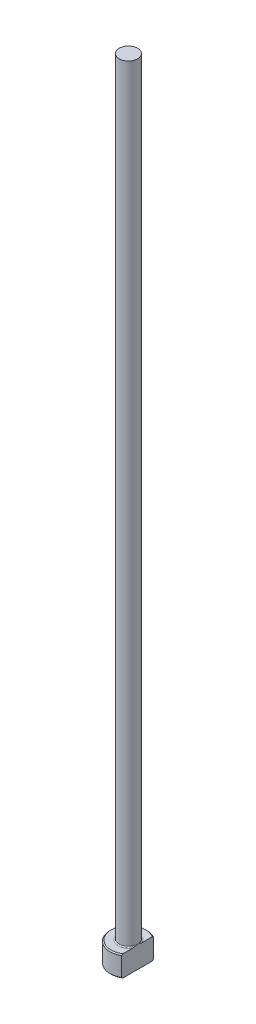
ISO-10303-21;
HEADER;
FILE_DESCRIPTION(('STEP AP214'),'2;1');
FILE_NAME('part.step','',(''),(''),'','','');
FILE_SCHEMA(('AUTOMOTIVE_DESIGN { 1 0 10303 214 1 1 1 1 }'));
ENDSEC;
DATA;
#1=APPLICATION_CONTEXT('core data for automotive mechanical design processes');
#2=APPLICATION_PROTOCOL_DEFINITION('international standard','automotive_design',2000,#1);
#3=PRODUCT_CONTEXT('',#1,'mechanical');
#4=PRODUCT('Part','Part','',(#3));
#5=PRODUCT_RELATED_PRODUCT_CATEGORY('part','',(#4));
#6=PRODUCT_DEFINITION_FORMATION('','',#4);
#7=PRODUCT_DEFINITION_CONTEXT('part definition',#1,'design');
#8=PRODUCT_DEFINITION('design','',#6,#7);
#9=PRODUCT_DEFINITION_SHAPE('','',#8);
#10=(LENGTH_UNIT() NAMED_UNIT(*) SI_UNIT(.MILLI.,.METRE.));
#11=(NAMED_UNIT(*) PLANE_ANGLE_UNIT() SI_UNIT($,.RADIAN.));
#12=(NAMED_UNIT(*) SI_UNIT($,.STERADIAN.) SOLID_ANGLE_UNIT());
#13=UNCERTAINTY_MEASURE_WITH_UNIT(LENGTH_MEASURE(1.E-05),#10,'distance_accuracy_value','');
#14=(GEOMETRIC_REPRESENTATION_CONTEXT(3) GLOBAL_UNCERTAINTY_ASSIGNED_CONTEXT((#13)) GLOBAL_UNIT_ASSIGNED_CONTEXT((#10,
#11,#12)) REPRESENTATION_CONTEXT('',''));
#15=CARTESIAN_POINT('',(0.,0.,0.));
#16=DIRECTION('',(0.,0.,1.));
#17=DIRECTION('',(1.,0.,0.));
#18=AXIS2_PLACEMENT_3D('',#15,#16,#17);
#19=CARTESIAN_POINT('',(0.,0.,0.));
#20=DIRECTION('',(0.,-1.,0.));
#21=DIRECTION('',(0.,0.,-1.));
#22=AXIS2_PLACEMENT_3D('',#19,#20,#21);
#23=PLANE('',#22);
#24=CARTESIAN_POINT('',(0.,0.,0.));
#25=DIRECTION('',(0.,-1.,0.));
#26=DIRECTION('',(0.,0.,-1.));
#27=AXIS2_PLACEMENT_3D('',#24,#25,#26);
#28=CIRCLE('',#27,3.29999999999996);
#29=CARTESIAN_POINT('',(1.74999999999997,0.,2.79776696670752));
#30=VERTEX_POINT('',#29);
#31=CARTESIAN_POINT('',(1.74999999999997,0.,-2.79776696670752));
#32=VERTEX_POINT('',#31);
#33=EDGE_CURVE('E98',#30,#32,#28,.T.);
#34=ORIENTED_EDGE('',*,*,#33,.T.);
#35=DIRECTION('',(0.,0.,1.));
#36=VECTOR('',#35,1.);
#37=CARTESIAN_POINT('',(1.74999999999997,0.,3.03108891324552));
#38=LINE('',#37,#36);
#39=EDGE_CURVE('E83',#32,#30,#38,.T.);
#40=ORIENTED_EDGE('',*,*,#39,.T.);
#41=EDGE_LOOP('',(#34,#40));
#42=FACE_BOUND('',#41,.T.);
#43=ADVANCED_FACE('F32',(#42),#23,.T.);
#44=CARTESIAN_POINT('',(0.,259.958771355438,0.));
#45=DIRECTION('',(0.,1.,0.));
#46=DIRECTION('',(0.,0.,1.));
#47=AXIS2_PLACEMENT_3D('',#44,#45,#46);
#48=CYLINDRICAL_SURFACE('',#47,3.49999999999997);
#49=CARTESIAN_POINT('',(0.,3.79999999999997,0.));
#50=DIRECTION('',(0.,1.,0.));
#51=DIRECTION('',(0.,0.,1.));
#52=AXIS2_PLACEMENT_3D('',#49,#50,#51);
#53=CIRCLE('',#52,3.49999999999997);
#54=CARTESIAN_POINT('',(1.74999999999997,3.79999999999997,3.03108891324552));
#55=VERTEX_POINT('',#54);
#56=CARTESIAN_POINT('',(1.74999999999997,3.79999999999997,-3.03108891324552));
#57=VERTEX_POINT('',#56);
#58=EDGE_CURVE('E104',#55,#57,#53,.F.);
#59=ORIENTED_EDGE('',*,*,#58,.T.);
#60=DIRECTION('',(0.,-1.,0.));
#61=VECTOR('',#60,1.);
#62=CARTESIAN_POINT('',(1.74999999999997,150.,-3.03108891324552));
#63=LINE('',#62,#61);
#64=CARTESIAN_POINT('',(1.74999999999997,0.200000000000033,-3.03108891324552));
#65=VERTEX_POINT('',#64);
#66=EDGE_CURVE('E183',#57,#65,#63,.T.);
#67=ORIENTED_EDGE('',*,*,#66,.T.);
#68=CARTESIAN_POINT('',(0.,0.200000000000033,0.));
#69=DIRECTION('',(0.,-1.,0.));
#70=DIRECTION('',(0.,0.,-1.));
#71=AXIS2_PLACEMENT_3D('',#68,#69,#70);
#72=CIRCLE('',#71,3.49999999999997);
#73=CARTESIAN_POINT('',(1.74999999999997,0.200000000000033,3.03108891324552));
#74=VERTEX_POINT('',#73);
#75=EDGE_CURVE('E100',#65,#74,#72,.F.);
#76=ORIENTED_EDGE('',*,*,#75,.T.);
#77=DIRECTION('',(0.,-1.,0.));
#78=VECTOR('',#77,1.);
#79=CARTESIAN_POINT('',(1.74999999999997,150.,3.03108891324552));
#80=LINE('',#79,#78);
#81=EDGE_CURVE('E93',#55,#74,#80,.T.);
#82=ORIENTED_EDGE('',*,*,#81,.F.);
#83=EDGE_LOOP('',(#59,#67,#76,#82));
#84=FACE_BOUND('',#83,.T.);
#85=ADVANCED_FACE('F158',(#84),#48,.T.);
#86=CARTESIAN_POINT('',(-3.49999999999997,4.,0.));
#87=DIRECTION('',(0.,1.,0.));
#88=DIRECTION('',(0.,0.,1.));
#89=AXIS2_PLACEMENT_3D('',#86,#87,#88);
#90=PLANE('',#89);
#91=CARTESIAN_POINT('',(0.,4.,0.));
#92=DIRECTION('',(0.,1.,0.));
#93=DIRECTION('',(0.,0.,1.));
#94=AXIS2_PLACEMENT_3D('',#91,#92,#93);
#95=CIRCLE('',#94,3.29999999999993);
#96=CARTESIAN_POINT('',(1.74999999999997,4.,-2.79776696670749));
#97=VERTEX_POINT('',#96);
#98=CARTESIAN_POINT('',(1.74999999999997,4.,2.79776696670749));
#99=VERTEX_POINT('',#98);
#100=EDGE_CURVE('E178',#97,#99,#95,.T.);
#101=ORIENTED_EDGE('',*,*,#100,.T.);
#102=DIRECTION('',(0.,0.,-1.));
#103=VECTOR('',#102,1.);
#104=CARTESIAN_POINT('',(1.74999999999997,4.,0.));
#105=LINE('',#104,#103);
#106=CARTESIAN_POINT('',(1.74999999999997,3.99999999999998,0.860232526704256));
#107=VERTEX_POINT('',#106);
#108=EDGE_CURVE('E57',#99,#107,#105,.T.);
#109=ORIENTED_EDGE('',*,*,#108,.T.);
#110=CARTESIAN_POINT('',(0.,4.,0.));
#111=DIRECTION('',(0.,1.,0.));
#112=DIRECTION('',(0.,0.,1.));
#113=AXIS2_PLACEMENT_3D('',#110,#111,#112);
#114=CIRCLE('',#113,1.94999999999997);
#115=CARTESIAN_POINT('',(1.74999999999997,3.99999999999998,-0.860232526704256));
#116=VERTEX_POINT('',#115);
#117=EDGE_CURVE('E107',#107,#116,#114,.F.);
#118=ORIENTED_EDGE('',*,*,#117,.T.);
#119=EDGE_CURVE('E136',#116,#97,#105,.T.);
#120=ORIENTED_EDGE('',*,*,#119,.T.);
#121=EDGE_LOOP('',(#101,#109,#118,#120));
#122=FACE_BOUND('',#121,.T.);
#123=ADVANCED_FACE('F147',(#122),#90,.T.);
#124=CARTESIAN_POINT('',(0.,4.,0.));
#125=DIRECTION('',(0.,-1.,0.));
#126=DIRECTION('',(0.,0.,-1.));
#127=AXIS2_PLACEMENT_3D('',#124,#125,#126);
#128=CONICAL_SURFACE('',#127,3.29999999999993,0.785398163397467);
#129=ORIENTED_EDGE('',*,*,#58,.F.);
#130=CARTESIAN_POINT('',(1.74999999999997,0.403691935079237,6.67057455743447));
#131=CARTESIAN_POINT('',(1.74999999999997,0.549902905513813,6.5194071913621));
#132=CARTESIAN_POINT('',(1.74999999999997,0.695956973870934,6.36808756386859));
#133=CARTESIAN_POINT('',(1.74999999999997,0.987658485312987,6.06505321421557));
#134=CARTESIAN_POINT('',(1.74999999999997,1.13330592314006,5.91333848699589));
#135=CARTESIAN_POINT('',(1.74999999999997,1.42417201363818,5.60934946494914));
#136=CARTESIAN_POINT('',(1.74999999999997,1.5693904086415,5.45707492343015));
#137=CARTESIAN_POINT('',(1.74999999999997,1.85918520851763,5.15191761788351));
#138=CARTESIAN_POINT('',(1.74999999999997,2.0037616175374,4.99903485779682));
#139=CARTESIAN_POINT('',(1.74999999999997,2.28922437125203,4.69552747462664));
#140=CARTESIAN_POINT('',(1.74999999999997,2.43012702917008,4.54491820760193));
#141=CARTESIAN_POINT('',(1.74999999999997,2.71087777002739,4.24272028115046));
#142=CARTESIAN_POINT('',(1.74999999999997,2.8507258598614,4.09113162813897));
#143=CARTESIAN_POINT('',(1.74999999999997,3.12895853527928,3.78667524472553));
#144=CARTESIAN_POINT('',(1.74999999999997,3.26734342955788,3.63380779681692));
#145=CARTESIAN_POINT('',(1.74999999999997,3.54209958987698,3.32627683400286));
#146=CARTESIAN_POINT('',(1.74999999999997,3.67847093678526,3.17161339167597));
#147=CARTESIAN_POINT('',(1.74999999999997,3.8961728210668,2.91990258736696));
#148=CARTESIAN_POINT('',(1.74999999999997,3.97843114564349,2.82365864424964));
#149=CARTESIAN_POINT('',(1.74999999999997,4.14148360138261,2.62991861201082));
#150=CARTESIAN_POINT('',(1.74999999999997,4.2222775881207,2.53242240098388));
#151=CARTESIAN_POINT('',(1.74999999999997,4.38274452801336,2.3347903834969));
#152=CARTESIAN_POINT('',(1.74999999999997,4.46239661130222,2.23463757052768));
#153=CARTESIAN_POINT('',(1.74999999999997,4.61891495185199,2.03220225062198));
#154=CARTESIAN_POINT('',(1.74999999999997,4.6957818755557,1.92992026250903));
#155=CARTESIAN_POINT('',(1.74999999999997,4.84669654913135,1.72090511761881));
#156=CARTESIAN_POINT('',(1.74999999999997,4.92068375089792,1.61412795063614));
#157=CARTESIAN_POINT('',(1.74999999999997,5.06269616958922,1.39638381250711));
#158=CARTESIAN_POINT('',(1.74999999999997,5.13071318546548,1.28541136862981));
#159=CARTESIAN_POINT('',(1.74999999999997,5.22516490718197,1.11561175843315));
#160=CARTESIAN_POINT('',(1.74999999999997,5.25522351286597,1.05881631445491));
#161=CARTESIAN_POINT('',(1.74999999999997,5.31237042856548,0.943756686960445));
#162=CARTESIAN_POINT('',(1.74999999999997,5.33945819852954,0.885492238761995));
#163=CARTESIAN_POINT('',(1.74999999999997,5.41499290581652,0.708569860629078));
#164=CARTESIAN_POINT('',(1.74999999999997,5.45796078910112,0.587356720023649));
#165=CARTESIAN_POINT('',(1.74999999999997,5.50447230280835,0.405622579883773));
#166=CARTESIAN_POINT('',(1.74999999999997,5.51680920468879,0.347327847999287));
#167=CARTESIAN_POINT('',(1.74999999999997,5.53592536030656,0.229813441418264));
#168=CARTESIAN_POINT('',(1.74999999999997,5.54270510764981,0.170593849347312));
#169=CARTESIAN_POINT('',(1.74999999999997,5.55022681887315,0.0519516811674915));
#170=CARTESIAN_POINT('',(1.74999999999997,5.5509874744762,-0.0074696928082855));
#171=CARTESIAN_POINT('',(1.74999999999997,5.54646541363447,-0.126082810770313));
#172=CARTESIAN_POINT('',(1.74999999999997,5.54118219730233,-0.185274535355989));
#173=CARTESIAN_POINT('',(1.74999999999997,5.525011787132,-0.302357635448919));
#174=CARTESIAN_POINT('',(1.74999999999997,5.51417270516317,-0.360255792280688));
#175=CARTESIAN_POINT('',(1.74999999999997,5.48756668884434,-0.474896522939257));
#176=CARTESIAN_POINT('',(1.74999999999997,5.47179916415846,-0.531638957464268));
#177=CARTESIAN_POINT('',(1.74999999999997,5.43599695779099,-0.644103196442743));
#178=CARTESIAN_POINT('',(1.74999999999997,5.41593824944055,-0.699817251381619));
#179=CARTESIAN_POINT('',(1.74999999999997,5.37235913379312,-0.809843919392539));
#180=CARTESIAN_POINT('',(1.74999999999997,5.34883943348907,-0.864156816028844));
#181=CARTESIAN_POINT('',(1.74999999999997,5.27385837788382,-1.02562379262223));
#182=CARTESIAN_POINT('',(1.74999999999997,5.21814894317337,-1.13079943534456));
#183=CARTESIAN_POINT('',(1.74999999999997,5.09935726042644,-1.33694307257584));
#184=CARTESIAN_POINT('',(1.74999999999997,5.03626572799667,-1.43790554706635));
#185=CARTESIAN_POINT('',(1.74999999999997,4.90490246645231,-1.63694628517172));
#186=CARTESIAN_POINT('',(1.74999999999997,4.83661129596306,-1.73501160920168));
#187=CARTESIAN_POINT('',(1.74999999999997,4.69663576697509,-1.92859117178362));
#188=CARTESIAN_POINT('',(1.74999999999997,4.62495312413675,-2.02410666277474));
#189=CARTESIAN_POINT('',(1.74999999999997,4.47817312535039,-2.21448054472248));
#190=CARTESIAN_POINT('',(1.74999999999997,4.40304324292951,-2.30931373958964));
#191=CARTESIAN_POINT('',(1.74999999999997,4.25092223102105,-2.49748629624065));
#192=CARTESIAN_POINT('',(1.74999999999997,4.17393090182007,-2.59082549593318));
#193=CARTESIAN_POINT('',(1.74999999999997,4.01873588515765,-2.77610276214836));
#194=CARTESIAN_POINT('',(1.74999999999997,3.94053559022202,-2.86804367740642));
#195=CARTESIAN_POINT('',(1.74999999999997,3.78305359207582,-3.0509955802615));
#196=CARTESIAN_POINT('',(1.74999999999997,3.70377186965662,-3.14200655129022));
#197=CARTESIAN_POINT('',(1.74999999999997,3.4917775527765,-3.38307713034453));
#198=CARTESIAN_POINT('',(1.74999999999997,3.35832098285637,-3.53248201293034));
#199=CARTESIAN_POINT('',(1.74999999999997,3.0897768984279,-3.82982116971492));
#200=CARTESIAN_POINT('',(1.74999999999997,2.95468933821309,-3.97775540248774));
#201=CARTESIAN_POINT('',(1.74999999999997,2.68319766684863,-4.27266697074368));
#202=CARTESIAN_POINT('',(1.74999999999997,2.54679243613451,-4.41964327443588));
#203=CARTESIAN_POINT('',(1.74999999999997,2.27308598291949,-4.71275937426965));
#204=CARTESIAN_POINT('',(1.74999999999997,2.13578475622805,-4.85889916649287));
#205=CARTESIAN_POINT('',(1.74999999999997,1.73418398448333,-5.28435414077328));
#206=CARTESIAN_POINT('',(1.74999999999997,1.46897142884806,-5.5628072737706));
#207=CARTESIAN_POINT('',(1.74999999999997,1.07010496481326,-5.97918348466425));
#208=CARTESIAN_POINT('',(1.74999999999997,0.937049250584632,-6.11768155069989));
#209=CARTESIAN_POINT('',(1.74999999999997,0.670604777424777,-6.39435480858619));
#210=CARTESIAN_POINT('',(1.74999999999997,0.53721602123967,-6.53253000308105));
#211=CARTESIAN_POINT('',(1.74999999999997,0.403691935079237,-6.67057455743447));
#212=B_SPLINE_CURVE_WITH_KNOTS('',3,(#130,#131,#132,#133,#134,#135,#136,#137,#138,#139,#140,
#141,#142,#143,#144,#145,#146,#147,#148,#149,#150,#151,#152,#153,#154,#155,#156,#157,#158,#159,
#160,#161,#162,#163,#164,#165,#166,#167,#168,#169,#170,#171,#172,#173,#174,#175,#176,#177,#178,
#179,#180,#181,#182,#183,#184,#185,#186,#187,#188,#189,#190,#191,#192,#193,#194,#195,#196,#197,
#198,#199,#200,#201,#202,#203,#204,#205,#206,#207,#208,#209,#210,#211),.UNSPECIFIED.,.F.,.F.,(4,
2,2,2,2,2,2,2,2,2,2,2,2,2,2,2,2,2,2,2,2,2,2,2,2,2,2,2,2,2,2,2,2,2,2,2,2,2,2,2,4),(0.,
0.63092275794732,1.26185363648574,1.89310749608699,2.5243572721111,3.14308654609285,
3.76181177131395,4.38040374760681,4.9989708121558,5.37878108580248,5.75862861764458,
6.14249031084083,6.52625953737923,6.91585739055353,7.30598230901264,7.4986761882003,
7.69140503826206,8.07538783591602,8.25392686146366,8.43245002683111,8.61041858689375,
8.78840186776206,8.96486927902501,9.1413578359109,9.3188617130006,9.49632938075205,
9.8528627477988,10.209849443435,10.5682434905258,10.9264581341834,11.2893876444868,
11.6523562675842,12.014444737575,12.3765396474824,12.977513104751,13.5785034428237,
14.1800594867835,14.7816183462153,15.9352370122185,16.5114050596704,17.0875683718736),.UNSPECIFIED.);
#213=EDGE_CURVE('E135',#55,#99,#212,.T.);
#214=ORIENTED_EDGE('',*,*,#213,.T.);
#215=ORIENTED_EDGE('',*,*,#100,.F.);
#216=EDGE_CURVE('E127',#97,#57,#212,.T.);
#217=ORIENTED_EDGE('',*,*,#216,.T.);
#218=EDGE_LOOP('',(#129,#214,#215,#217));
#219=FACE_BOUND('',#218,.T.);
#220=ADVANCED_FACE('F143',(#219),#128,.T.);
#221=CARTESIAN_POINT('',(0.,0.200000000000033,0.));
#222=DIRECTION('',(0.,1.,0.));
#223=DIRECTION('',(0.,0.,1.));
#224=AXIS2_PLACEMENT_3D('',#221,#222,#223);
#225=CONICAL_SURFACE('',#224,3.49999999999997,0.785398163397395);
#226=ORIENTED_EDGE('',*,*,#75,.F.);
#227=CARTESIAN_POINT('',(1.74999999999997,3.59630806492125,-6.67057455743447));
#228=CARTESIAN_POINT('',(1.74999999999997,3.45009709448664,-6.51940719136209));
#229=CARTESIAN_POINT('',(1.74999999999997,3.30404302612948,-6.36808756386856));
#230=CARTESIAN_POINT('',(1.74999999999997,3.01234151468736,-6.06505321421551));
#231=CARTESIAN_POINT('',(1.74999999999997,2.86669407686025,-5.91333848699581));
#232=CARTESIAN_POINT('',(1.74999999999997,2.57582798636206,-5.60934946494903));
#233=CARTESIAN_POINT('',(1.74999999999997,2.4306095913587,-5.45707492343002));
#234=CARTESIAN_POINT('',(1.74999999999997,2.1408147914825,-5.15191761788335));
#235=CARTESIAN_POINT('',(1.74999999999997,1.9962383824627,-4.99903485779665));
#236=CARTESIAN_POINT('',(1.74999999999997,1.710775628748,-4.69552747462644));
#237=CARTESIAN_POINT('',(1.74999999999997,1.56987297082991,-4.54491820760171));
#238=CARTESIAN_POINT('',(1.74999999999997,1.28912222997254,-4.24272028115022));
#239=CARTESIAN_POINT('',(1.74999999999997,1.1492741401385,-4.09113162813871));
#240=CARTESIAN_POINT('',(1.74999999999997,0.871041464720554,-3.78667524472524));
#241=CARTESIAN_POINT('',(1.74999999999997,0.732656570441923,-3.63380779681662));
#242=CARTESIAN_POINT('',(1.74999999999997,0.457900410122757,-3.32627683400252));
#243=CARTESIAN_POINT('',(1.74999999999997,0.321529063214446,-3.17161339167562));
#244=CARTESIAN_POINT('',(1.74999999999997,0.103827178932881,-2.9199025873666));
#245=CARTESIAN_POINT('',(1.74999999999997,0.021568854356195,-2.8236586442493));
#246=CARTESIAN_POINT('',(1.74999999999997,-0.141483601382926,-2.62991861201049));
#247=CARTESIAN_POINT('',(1.74999999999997,-0.222277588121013,-2.53242240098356));
#248=CARTESIAN_POINT('',(1.74999999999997,-0.382744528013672,-2.33479038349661));
#249=CARTESIAN_POINT('',(1.74999999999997,-0.462396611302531,-2.23463757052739));
#250=CARTESIAN_POINT('',(1.74999999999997,-0.618914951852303,-2.03220225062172));
#251=CARTESIAN_POINT('',(1.74999999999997,-0.695781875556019,-1.92992026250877));
#252=CARTESIAN_POINT('',(1.74999999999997,-0.846696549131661,-1.72090511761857));
#253=CARTESIAN_POINT('',(1.74999999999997,-0.920683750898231,-1.61412795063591));
#254=CARTESIAN_POINT('',(1.74999999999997,-1.06269616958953,-1.39638381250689));
#255=CARTESIAN_POINT('',(1.74999999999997,-1.13071318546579,-1.2854113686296));
#256=CARTESIAN_POINT('',(1.74999999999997,-1.22516490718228,-1.11561175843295));
#257=CARTESIAN_POINT('',(1.74999999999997,-1.25522351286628,-1.05881631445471));
#258=CARTESIAN_POINT('',(1.74999999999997,-1.31237042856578,-0.943756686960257));
#259=CARTESIAN_POINT('',(1.74999999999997,-1.33945819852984,-0.885492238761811));
#260=CARTESIAN_POINT('',(1.74999999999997,-1.41499290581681,-0.708569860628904));
#261=CARTESIAN_POINT('',(1.74999999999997,-1.45796078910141,-0.587356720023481));
#262=CARTESIAN_POINT('',(1.74999999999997,-1.50447230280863,-0.405622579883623));
#263=CARTESIAN_POINT('',(1.74999999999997,-1.51680920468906,-0.347327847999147));
#264=CARTESIAN_POINT('',(1.74999999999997,-1.53592536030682,-0.229813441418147));
#265=CARTESIAN_POINT('',(1.74999999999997,-1.54270510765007,-0.170593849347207));
#266=CARTESIAN_POINT('',(1.74999999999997,-1.5502268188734,-0.0519516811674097));
#267=CARTESIAN_POINT('',(1.74999999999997,-1.55098747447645,0.00746969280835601));
#268=CARTESIAN_POINT('',(1.74999999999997,-1.54646541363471,0.126082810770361));
#269=CARTESIAN_POINT('',(1.74999999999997,-1.54118219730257,0.185274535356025));
#270=CARTESIAN_POINT('',(1.74999999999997,-1.52501178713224,0.302357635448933));
#271=CARTESIAN_POINT('',(1.74999999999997,-1.51417270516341,0.360255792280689));
#272=CARTESIAN_POINT('',(1.74999999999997,-1.48756668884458,0.474896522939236));
#273=CARTESIAN_POINT('',(1.74999999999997,-1.4717991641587,0.531638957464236));
#274=CARTESIAN_POINT('',(1.74999999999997,-1.43599695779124,0.644103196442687));
#275=CARTESIAN_POINT('',(1.74999999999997,-1.4159382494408,0.699817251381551));
#276=CARTESIAN_POINT('',(1.74999999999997,-1.37235913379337,0.809843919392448));
#277=CARTESIAN_POINT('',(1.74999999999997,-1.34883943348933,0.864156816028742));
#278=CARTESIAN_POINT('',(1.74999999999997,-1.2738583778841,1.02562379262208));
#279=CARTESIAN_POINT('',(1.74999999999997,-1.21814894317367,1.13079943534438));
#280=CARTESIAN_POINT('',(1.74999999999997,-1.09935726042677,1.33694307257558));
#281=CARTESIAN_POINT('',(1.74999999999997,-1.03626572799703,1.43790554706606));
#282=CARTESIAN_POINT('',(1.74999999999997,-0.904902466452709,1.63694628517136));
#283=CARTESIAN_POINT('',(1.74999999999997,-0.83661129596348,1.73501160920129));
#284=CARTESIAN_POINT('',(1.74999999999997,-0.69663576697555,1.92859117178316));
#285=CARTESIAN_POINT('',(1.74999999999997,-0.624953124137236,2.02410666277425));
#286=CARTESIAN_POINT('',(1.74999999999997,-0.47817312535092,2.21448054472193));
#287=CARTESIAN_POINT('',(1.74999999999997,-0.403043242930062,2.30931373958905));
#288=CARTESIAN_POINT('',(1.74999999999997,-0.250922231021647,2.49748629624));
#289=CARTESIAN_POINT('',(1.74999999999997,-0.173930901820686,2.5908254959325));
#290=CARTESIAN_POINT('',(1.74999999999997,-0.0187358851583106,2.77610276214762));
#291=CARTESIAN_POINT('',(1.74999999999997,0.059464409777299,2.86804367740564));
#292=CARTESIAN_POINT('',(1.74999999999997,0.216946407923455,3.05099558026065));
#293=CARTESIAN_POINT('',(1.74999999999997,0.296228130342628,3.14200655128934));
#294=CARTESIAN_POINT('',(1.74999999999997,0.508222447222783,3.38307713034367));
#295=CARTESIAN_POINT('',(1.74999999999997,0.641679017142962,3.53248201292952));
#296=CARTESIAN_POINT('',(1.74999999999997,0.910223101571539,3.82982116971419));
#297=CARTESIAN_POINT('',(1.74999999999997,1.04531066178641,3.97775540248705));
#298=CARTESIAN_POINT('',(1.74999999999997,1.31680233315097,4.27266697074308));
#299=CARTESIAN_POINT('',(1.74999999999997,1.45320756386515,4.41964327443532));
#300=CARTESIAN_POINT('',(1.74999999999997,1.72691401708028,4.71275937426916));
#301=CARTESIAN_POINT('',(1.74999999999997,1.86421524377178,4.85889916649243));
#302=CARTESIAN_POINT('',(1.74999999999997,2.26581601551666,5.28435414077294));
#303=CARTESIAN_POINT('',(1.74999999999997,2.53102857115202,5.56280727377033));
#304=CARTESIAN_POINT('',(1.74999999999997,2.92989503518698,5.97918348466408));
#305=CARTESIAN_POINT('',(1.74999999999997,3.06295074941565,6.11768155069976));
#306=CARTESIAN_POINT('',(1.74999999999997,3.32939522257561,6.39435480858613));
#307=CARTESIAN_POINT('',(1.74999999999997,3.46278397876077,6.53253000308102));
#308=CARTESIAN_POINT('',(1.74999999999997,3.59630806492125,6.67057455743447));
#309=B_SPLINE_CURVE_WITH_KNOTS('',3,(#227,#228,#229,#230,#231,#232,#233,#234,#235,#236,#237,
#238,#239,#240,#241,#242,#243,#244,#245,#246,#247,#248,#249,#250,#251,#252,#253,#254,#255,#256,
#257,#258,#259,#260,#261,#262,#263,#264,#265,#266,#267,#268,#269,#270,#271,#272,#273,#274,#275,
#276,#277,#278,#279,#280,#281,#282,#283,#284,#285,#286,#287,#288,#289,#290,#291,#292,#293,#294,
#295,#296,#297,#298,#299,#300,#301,#302,#303,#304,#305,#306,#307,#308),.UNSPECIFIED.,.F.,.F.,(4,
2,2,2,2,2,2,2,2,2,2,2,2,2,2,2,2,2,2,2,2,2,2,2,2,2,2,2,2,2,2,2,2,2,2,2,2,2,2,2,4),(0.,
0.630922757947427,1.26185363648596,1.89310749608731,2.52435727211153,3.14308654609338,
3.76181177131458,4.38040374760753,4.99897081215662,5.37878108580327,5.75862861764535,
6.14249031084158,6.52625953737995,6.91585739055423,7.30598230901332,7.49867618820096,
7.69140503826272,8.07538783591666,8.25392686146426,8.43245002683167,8.61041858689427,
8.78840186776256,8.96486927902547,9.14135783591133,9.318861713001,9.49632938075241,
9.85286274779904,10.2098494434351,10.5682434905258,10.9264581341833,11.2893876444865,
11.6523562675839,12.0144447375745,12.3765396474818,12.9775131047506,13.5785034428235,
14.1800594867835,14.7816183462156,15.9352370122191,16.5114050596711,17.0875683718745),.UNSPECIFIED.);
#310=EDGE_CURVE('E86',#65,#32,#309,.T.);
#311=ORIENTED_EDGE('',*,*,#310,.T.);
#312=ORIENTED_EDGE('',*,*,#33,.F.);
#313=EDGE_CURVE('E89',#30,#74,#309,.T.);
#314=ORIENTED_EDGE('',*,*,#313,.T.);
#315=EDGE_LOOP('',(#226,#311,#312,#314));
#316=FACE_BOUND('',#315,.T.);
#317=ADVANCED_FACE('F97',(#316),#225,.T.);
#318=CARTESIAN_POINT('',(0.,4.19999999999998,0.));
#319=DIRECTION('',(0.,1.,0.));
#320=DIRECTION('',(0.,0.,1.));
#321=AXIS2_PLACEMENT_3D('',#318,#319,#320);
#322=TOROIDAL_SURFACE('',#321,1.94999999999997,0.2);
#323=CARTESIAN_POINT('',(1.74999999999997,4.19999999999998,0.));
#324=CARTESIAN_POINT('',(1.74999999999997,4.2000005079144,9.3867964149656E-11));
#325=CARTESIAN_POINT('',(1.74999999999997,4.20000101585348,-1.34501103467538E-07));
#326=CARTESIAN_POINT('',(1.74999999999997,4.20000198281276,-5.41283480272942E-07));
#327=CARTESIAN_POINT('',(1.74999999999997,4.20000243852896,-8.19487716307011E-07));
#328=CARTESIAN_POINT('',(1.74999999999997,4.2000033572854,-1.4843911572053E-06));
#329=CARTESIAN_POINT('',(1.74999999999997,4.20000381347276,-1.8805263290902E-06));
#330=CARTESIAN_POINT('',(1.74999999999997,4.2000046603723,-2.72280867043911E-06));
#331=CARTESIAN_POINT('',(1.74999999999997,4.20000505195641,-3.16812554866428E-06));
#332=CARTESIAN_POINT('',(1.74999999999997,4.20000641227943,-4.80772283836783E-06));
#333=CARTESIAN_POINT('',(1.74999999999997,4.20000730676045,-6.06508173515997E-06));
#334=CARTESIAN_POINT('',(1.74999999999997,4.20000885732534,-8.62364313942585E-06));
#335=CARTESIAN_POINT('',(1.74999999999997,4.2000095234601,-9.91907771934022E-06));
#336=CARTESIAN_POINT('',(1.74999999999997,4.20001212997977,-1.51310766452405E-05));
#337=CARTESIAN_POINT('',(1.74999999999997,4.20001395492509,-1.91092656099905E-05));
#338=CARTESIAN_POINT('',(1.74999999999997,4.200016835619,-2.68327807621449E-05));
#339=CARTESIAN_POINT('',(1.74999999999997,4.20001795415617,-3.05551301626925E-05));
#340=CARTESIAN_POINT('',(1.74999999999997,4.20002287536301,-4.68261375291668E-05));
#341=CARTESIAN_POINT('',(1.74999999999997,4.20002674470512,-5.93446279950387E-05));
#342=CARTESIAN_POINT('',(1.74999999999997,4.20003278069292,-8.25255943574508E-05));
#343=CARTESIAN_POINT('',(1.74999999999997,4.2000351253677,-9.31393224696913E-05));
#344=CARTESIAN_POINT('',(1.74999999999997,4.20005413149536,-0.000171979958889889));
#345=CARTESIAN_POINT('',(1.74999999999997,4.20007897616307,-0.000237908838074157));
#346=CARTESIAN_POINT('',(1.74999999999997,4.20017305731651,-0.000496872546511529));
#347=CARTESIAN_POINT('',(1.74999999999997,4.20023617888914,-0.000691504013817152));
#348=CARTESIAN_POINT('',(1.74999999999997,4.20048774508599,-0.00145613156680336));
#349=CARTESIAN_POINT('',(1.74999999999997,4.20068259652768,-0.00202450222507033));
#350=CARTESIAN_POINT('',(1.74999999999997,4.20148279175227,-0.00436941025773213));
#351=CARTESIAN_POINT('',(1.74999999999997,4.20208089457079,-0.00614773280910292));
#352=CARTESIAN_POINT('',(1.74999999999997,4.20853845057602,-0.0253339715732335));
#353=CARTESIAN_POINT('',(1.74999999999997,4.21443574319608,-0.0427328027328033));
#354=CARTESIAN_POINT('',(1.74999999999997,4.22594434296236,-0.076884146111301));
#355=CARTESIAN_POINT('',(1.74999999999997,4.23155796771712,-0.0936359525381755));
#356=CARTESIAN_POINT('',(1.74999999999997,4.24339960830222,-0.129193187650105));
#357=CARTESIAN_POINT('',(1.74999999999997,4.24961959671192,-0.148001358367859));
#358=CARTESIAN_POINT('',(1.74999999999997,4.26199268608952,-0.185858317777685));
#359=CARTESIAN_POINT('',(1.74999999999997,4.26814439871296,-0.204907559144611));
#360=CARTESIAN_POINT('',(1.74999999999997,4.28302129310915,-0.251728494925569));
#361=CARTESIAN_POINT('',(1.74999999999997,4.2916463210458,-0.279532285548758));
#362=CARTESIAN_POINT('',(1.74999999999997,4.30815507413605,-0.334622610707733));
#363=CARTESIAN_POINT('',(1.74999999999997,4.3160517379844,-0.36190524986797));
#364=CARTESIAN_POINT('',(1.74999999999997,4.33270110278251,-0.422187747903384));
#365=CARTESIAN_POINT('',(1.74999999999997,4.34130455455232,-0.455229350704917));
#366=CARTESIAN_POINT('',(1.74999999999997,4.35728256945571,-0.521873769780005));
#367=CARTESIAN_POINT('',(1.74999999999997,4.36464748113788,-0.555478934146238));
#368=CARTESIAN_POINT('',(1.74999999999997,4.37810121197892,-0.625225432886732));
#369=CARTESIAN_POINT('',(1.74999999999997,4.38407559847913,-0.661389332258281));
#370=CARTESIAN_POINT('',(1.74999999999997,4.39348021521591,-0.733973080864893));
#371=CARTESIAN_POINT('',(1.74999999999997,4.39691695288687,-0.77039203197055));
#372=CARTESIAN_POINT('',(1.74999999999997,4.39990626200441,-0.832262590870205));
#373=CARTESIAN_POINT('',(1.74999999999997,4.40032395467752,-0.857670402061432));
#374=CARTESIAN_POINT('',(1.74999999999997,4.39916217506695,-0.908260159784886));
#375=CARTESIAN_POINT('',(1.74999999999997,4.39759783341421,-0.933442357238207));
#376=CARTESIAN_POINT('',(1.74999999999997,4.39129859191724,-0.989903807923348));
#377=CARTESIAN_POINT('',(1.74999999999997,4.38586007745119,-1.02110925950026));
#378=CARTESIAN_POINT('',(1.74999999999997,4.36964168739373,-1.08216800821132));
#379=CARTESIAN_POINT('',(1.74999999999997,4.35888918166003,-1.11202738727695));
#380=CARTESIAN_POINT('',(1.74999999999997,4.33961802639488,-1.14878048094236));
#381=CARTESIAN_POINT('',(1.74999999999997,4.33455492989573,-1.15748014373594));
#382=CARTESIAN_POINT('',(1.74999999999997,4.32351587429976,-1.17429661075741));
#383=CARTESIAN_POINT('',(1.74999999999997,4.31753946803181,-1.18241312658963));
#384=CARTESIAN_POINT('',(1.74999999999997,4.30451428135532,-1.19787793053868));
#385=CARTESIAN_POINT('',(1.74999999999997,4.29745609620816,-1.20521842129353));
#386=CARTESIAN_POINT('',(1.74999999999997,4.28223524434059,-1.21865698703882));
#387=CARTESIAN_POINT('',(1.74999999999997,4.27407476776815,-1.22475746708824));
#388=CARTESIAN_POINT('',(1.74999999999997,4.25920166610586,-1.23370537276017));
#389=CARTESIAN_POINT('',(1.74999999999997,4.25274944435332,-1.23698363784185));
#390=CARTESIAN_POINT('',(1.74999999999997,4.23939659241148,-1.24245066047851));
#391=CARTESIAN_POINT('',(1.74999999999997,4.23249637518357,-1.2446404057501));
#392=CARTESIAN_POINT('',(1.74999999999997,4.21836445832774,-1.24776583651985));
#393=CARTESIAN_POINT('',(1.74999999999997,4.21113087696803,-1.24869317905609));
#394=CARTESIAN_POINT('',(1.74999999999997,4.19661788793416,-1.24917680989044));
#395=CARTESIAN_POINT('',(1.74999999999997,4.18933848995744,-1.2487333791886));
#396=CARTESIAN_POINT('',(1.74999999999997,4.17564813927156,-1.2466228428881));
#397=CARTESIAN_POINT('',(1.74999999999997,4.16921873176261,-1.24507159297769));
#398=CARTESIAN_POINT('',(1.74999999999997,4.1566813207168,-1.24099086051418));
#399=CARTESIAN_POINT('',(1.74999999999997,4.15057343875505,-1.23846101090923));
#400=CARTESIAN_POINT('',(1.74999999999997,4.13656990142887,-1.23147130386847));
#401=CARTESIAN_POINT('',(1.74999999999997,4.12885825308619,-1.22664351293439));
#402=CARTESIAN_POINT('',(1.74999999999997,4.11430996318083,-1.21581214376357));
#403=CARTESIAN_POINT('',(1.74999999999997,4.10747539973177,-1.20980585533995));
#404=CARTESIAN_POINT('',(1.74999999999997,4.09141283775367,-1.19367262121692));
#405=CARTESIAN_POINT('',(1.74999999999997,4.08273353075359,-1.18300273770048));
#406=CARTESIAN_POINT('',(1.74999999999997,4.06710756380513,-1.16049397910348));
#407=CARTESIAN_POINT('',(1.74999999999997,4.06016260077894,-1.14865397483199));
#408=CARTESIAN_POINT('',(1.74999999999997,4.04314403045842,-1.11526045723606));
#409=CARTESIAN_POINT('',(1.74999999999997,4.03452872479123,-1.09297031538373));
#410=CARTESIAN_POINT('',(1.74999999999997,4.02051872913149,-1.04724849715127));
#411=CARTESIAN_POINT('',(1.74999999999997,4.015155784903,-1.02380790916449));
#412=CARTESIAN_POINT('',(1.74999999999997,4.00698483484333,-0.976403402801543));
#413=CARTESIAN_POINT('',(1.74999999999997,4.00418732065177,-0.952437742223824));
#414=CARTESIAN_POINT('',(1.74999999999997,4.00064912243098,-0.904321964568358));
#415=CARTESIAN_POINT('',(1.74999999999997,3.99991269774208,-0.88017156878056));
#416=CARTESIAN_POINT('',(1.74999999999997,4.00019275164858,-0.809643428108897));
#417=CARTESIAN_POINT('',(1.74999999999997,4.00344813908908,-0.763278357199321));
#418=CARTESIAN_POINT('',(1.74999999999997,4.01492484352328,-0.664825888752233));
#419=CARTESIAN_POINT('',(1.74999999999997,4.02376250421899,-0.612819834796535));
#420=CARTESIAN_POINT('',(1.74999999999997,4.04538488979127,-0.508370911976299));
#421=CARTESIAN_POINT('',(1.74999999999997,4.0582587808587,-0.455947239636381));
#422=CARTESIAN_POINT('',(1.74999999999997,4.08196429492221,-0.368604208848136));
#423=CARTESIAN_POINT('',(1.74999999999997,4.09211504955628,-0.333493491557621));
#424=CARTESIAN_POINT('',(1.74999999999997,4.11312724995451,-0.263893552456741));
#425=CARTESIAN_POINT('',(1.74999999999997,4.12397997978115,-0.229401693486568));
#426=CARTESIAN_POINT('',(1.74999999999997,4.14496676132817,-0.164340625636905));
#427=CARTESIAN_POINT('',(1.74999999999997,4.15504975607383,-0.133754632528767));
#428=CARTESIAN_POINT('',(1.74999999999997,4.17587821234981,-0.0714242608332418));
#429=CARTESIAN_POINT('',(1.74999999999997,4.18663395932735,-0.0396831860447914));
#430=CARTESIAN_POINT('',(1.74999999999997,4.19791979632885,-0.00614534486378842));
#431=CARTESIAN_POINT('',(1.74999999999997,4.19851877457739,-0.00436467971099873));
#432=CARTESIAN_POINT('',(1.74999999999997,4.19931918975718,-0.00201922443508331));
#433=CARTESIAN_POINT('',(1.74999999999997,4.19951342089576,-0.00145265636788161));
#434=CARTESIAN_POINT('',(1.74999999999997,4.19976423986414,-0.000690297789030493));
#435=CARTESIAN_POINT('',(1.74999999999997,4.19982721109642,-0.000496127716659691));
#436=CARTESIAN_POINT('',(1.74999999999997,4.19992109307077,-0.000237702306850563));
#437=CARTESIAN_POINT('',(1.74999999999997,4.19994590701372,-0.000171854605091));
#438=CARTESIAN_POINT('',(1.74999999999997,4.19996489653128,-9.3104554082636E-05));
#439=CARTESIAN_POINT('',(1.74999999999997,4.1999672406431,-8.24963339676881E-05));
#440=CARTESIAN_POINT('',(1.74999999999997,4.19997327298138,-5.9327776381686E-05));
#441=CARTESIAN_POINT('',(1.74999999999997,4.19997713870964,-4.68160430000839E-05));
#442=CARTESIAN_POINT('',(1.74999999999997,4.19998205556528,-3.0552584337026E-05));
#443=CARTESIAN_POINT('',(1.74999999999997,4.19998317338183,-2.68310311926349E-05));
#444=CARTESIAN_POINT('',(1.74999999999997,4.19998605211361,-1.91090651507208E-05));
#445=CARTESIAN_POINT('',(1.74999999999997,4.1999878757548,-1.51315954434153E-05));
#446=CARTESIAN_POINT('',(1.74999999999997,4.19999048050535,-9.92029976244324E-06));
#447=CARTESIAN_POINT('',(1.74999999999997,4.19999114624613,-8.62492595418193E-06));
#448=CARTESIAN_POINT('',(1.74999999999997,4.19999269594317,-6.06641158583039E-06));
#449=CARTESIAN_POINT('',(1.74999999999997,4.19999358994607,-4.80903338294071E-06));
#450=CARTESIAN_POINT('',(1.74999999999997,4.19999494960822,-3.1693219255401E-06));
#451=CARTESIAN_POINT('',(1.74999999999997,4.19999534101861,-2.7239538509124E-06));
#452=CARTESIAN_POINT('',(1.74999999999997,4.19999618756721,-1.88153783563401E-06));
#453=CARTESIAN_POINT('',(1.74999999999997,4.19999664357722,-1.48531960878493E-06));
#454=CARTESIAN_POINT('',(1.74999999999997,4.19999756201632,-8.20216876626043E-07));
#455=CARTESIAN_POINT('',(1.74999999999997,4.19999801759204,-5.41901820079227E-07));
#456=CARTESIAN_POINT('',(1.74999999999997,4.19999898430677,-1.34847130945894E-07));
#457=CARTESIAN_POINT('',(1.74999999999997,4.19999949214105,-9.38577104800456E-11));
#458=CARTESIAN_POINT('',(1.74999999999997,4.19999999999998,0.));
#459=B_SPLINE_CURVE_WITH_KNOTS('',3,(#323,#324,#325,#326,#327,#328,#329,#330,#331,#332,#333,
#334,#335,#336,#337,#338,#339,#340,#341,#342,#343,#344,#345,#346,#347,#348,#349,#350,#351,#352,
#353,#354,#355,#356,#357,#358,#359,#360,#361,#362,#363,#364,#365,#366,#367,#368,#369,#370,#371,
#372,#373,#374,#375,#376,#377,#378,#379,#380,#381,#382,#383,#384,#385,#386,#387,#388,#389,#390,
#391,#392,#393,#394,#395,#396,#397,#398,#399,#400,#401,#402,#403,#404,#405,#406,#407,#408,#409,
#410,#411,#412,#413,#414,#415,#416,#417,#418,#419,#420,#421,#422,#423,#424,#425,#426,#427,#428,
#429,#430,#431,#432,#433,#434,#435,#436,#437,#438,#439,#440,#441,#442,#443,#444,#445,#446,#447,
#448,#449,#450,#451,#452,#453,#454,#455,#456,#457,#458),.UNSPECIFIED.,.T.,.F.,(4,2,2,2,2,2,2,2,
2,2,2,2,2,2,2,2,2,2,2,2,2,2,2,2,2,2,2,2,2,2,2,2,2,2,2,2,2,2,2,2,2,2,2,2,2,2,2,2,2,2,2,2,2,2,2,2,
2,2,2,2,2,2,2,2,2,2,2,4),(0.,1.52538200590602E-06,3.12059520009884E-06,4.92466441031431E-06,
6.70193570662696E-06,1.13103006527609E-05,1.56767122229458E-05,2.87740649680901E-05,
4.04214595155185E-05,7.97265132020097E-05,0.000112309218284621,0.000323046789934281,
0.000937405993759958,0.00273926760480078,0.00836862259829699,0.0634773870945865,
0.116480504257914,0.17590977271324,0.235963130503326,0.323291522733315,0.40849293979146,
0.510903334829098,0.614078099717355,0.723976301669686,0.833591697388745,0.909765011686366,
0.985360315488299,1.08013194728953,1.17442046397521,1.20457287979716,1.2347401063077,
1.26518627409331,1.29557281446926,1.3172031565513,1.33881383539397,1.36056665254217,
1.38231501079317,1.40207044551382,1.42183329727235,1.44897527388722,1.47618041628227,
1.51721056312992,1.55828069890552,1.62957223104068,1.70154887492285,1.77381858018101,
1.84623752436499,1.98535010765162,2.14342254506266,2.3052675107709,2.41490365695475,
2.52337268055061,2.6199888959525,2.72052170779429,2.72615854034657,2.72795468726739,
2.7285675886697,2.72877806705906,2.72881063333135,2.72884991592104,2.72886156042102,
2.7288746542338,2.72887901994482,2.72888362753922,2.72888540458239,2.72888720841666,
2.72888880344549,2.72889032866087),.UNSPECIFIED.);
#460=CARTESIAN_POINT('',(1.74999999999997,4.19999999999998,0.));
#461=VERTEX_POINT('',#460);
#462=EDGE_CURVE('E11',#116,#461,#459,.T.);
#463=ORIENTED_EDGE('',*,*,#462,.F.);
#464=ORIENTED_EDGE('',*,*,#117,.F.);
#465=CARTESIAN_POINT('',(1.74999999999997,4.19999999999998,0.));
#466=CARTESIAN_POINT('',(1.74999999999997,4.19999949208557,-9.386782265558E-11));
#467=CARTESIAN_POINT('',(1.74999999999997,4.19999898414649,1.34501103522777E-07));
#468=CARTESIAN_POINT('',(1.74999999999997,4.1999980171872,5.41283480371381E-07));
#469=CARTESIAN_POINT('',(1.74999999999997,4.199997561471,8.19487716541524E-07));
#470=CARTESIAN_POINT('',(1.74999999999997,4.19999664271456,1.48439115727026E-06));
#471=CARTESIAN_POINT('',(1.74999999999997,4.1999961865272,1.88052632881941E-06));
#472=CARTESIAN_POINT('',(1.74999999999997,4.19999533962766,2.72280867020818E-06));
#473=CARTESIAN_POINT('',(1.74999999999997,4.19999494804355,3.16812554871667E-06));
#474=CARTESIAN_POINT('',(1.74999999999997,4.19999358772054,4.80772283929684E-06));
#475=CARTESIAN_POINT('',(1.74999999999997,4.19999269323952,6.06508173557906E-06));
#476=CARTESIAN_POINT('',(1.74999999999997,4.19999114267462,8.62364313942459E-06));
#477=CARTESIAN_POINT('',(1.74999999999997,4.19999047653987,9.91907771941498E-06));
#478=CARTESIAN_POINT('',(1.74999999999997,4.19998787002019,1.51310766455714E-05));
#479=CARTESIAN_POINT('',(1.74999999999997,4.19998604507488,1.91092656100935E-05));
#480=CARTESIAN_POINT('',(1.74999999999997,4.19998316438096,2.68327807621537E-05));
#481=CARTESIAN_POINT('',(1.74999999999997,4.19998204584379,3.05551301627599E-05));
#482=CARTESIAN_POINT('',(1.74999999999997,4.19997712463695,4.68261375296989E-05));
#483=CARTESIAN_POINT('',(1.74999999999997,4.19997325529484,5.93446279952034E-05));
#484=CARTESIAN_POINT('',(1.74999999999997,4.19996721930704,8.25255943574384E-05));
#485=CARTESIAN_POINT('',(1.74999999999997,4.19996487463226,9.31393224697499E-05));
#486=CARTESIAN_POINT('',(1.74999999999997,4.19994586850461,0.000171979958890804));
#487=CARTESIAN_POINT('',(1.74999999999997,4.19992102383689,0.000237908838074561));
#488=CARTESIAN_POINT('',(1.74999999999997,4.19982694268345,0.000496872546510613));
#489=CARTESIAN_POINT('',(1.74999999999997,4.19976382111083,0.000691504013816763));
#490=CARTESIAN_POINT('',(1.74999999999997,4.19951225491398,0.00145613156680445));
#491=CARTESIAN_POINT('',(1.74999999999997,4.19931740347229,0.00202450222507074));
#492=CARTESIAN_POINT('',(1.74999999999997,4.19851720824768,0.00436941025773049));
#493=CARTESIAN_POINT('',(1.74999999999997,4.19791910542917,0.00614773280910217));
#494=CARTESIAN_POINT('',(1.74999999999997,4.19146154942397,0.0253339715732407));
#495=CARTESIAN_POINT('',(1.74999999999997,4.18556425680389,0.042732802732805));
#496=CARTESIAN_POINT('',(1.74999999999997,4.1740556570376,0.0768841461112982));
#497=CARTESIAN_POINT('',(1.74999999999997,4.16844203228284,0.0936359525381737));
#498=CARTESIAN_POINT('',(1.74999999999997,4.15660039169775,0.129193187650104));
#499=CARTESIAN_POINT('',(1.74999999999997,4.15038040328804,0.148001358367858));
#500=CARTESIAN_POINT('',(1.74999999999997,4.13800731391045,0.185858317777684));
#501=CARTESIAN_POINT('',(1.74999999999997,4.13185560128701,0.204907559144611));
#502=CARTESIAN_POINT('',(1.74999999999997,4.11697870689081,0.251728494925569));
#503=CARTESIAN_POINT('',(1.74999999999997,4.10835367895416,0.279532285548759));
#504=CARTESIAN_POINT('',(1.74999999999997,4.09184492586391,0.334622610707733));
#505=CARTESIAN_POINT('',(1.74999999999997,4.08394826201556,0.36190524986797));
#506=CARTESIAN_POINT('',(1.74999999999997,4.06729889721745,0.422187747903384));
#507=CARTESIAN_POINT('',(1.74999999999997,4.05869544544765,0.455229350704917));
#508=CARTESIAN_POINT('',(1.74999999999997,4.04271743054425,0.521873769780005));
#509=CARTESIAN_POINT('',(1.74999999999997,4.03535251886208,0.555478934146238));
#510=CARTESIAN_POINT('',(1.74999999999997,4.02189878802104,0.625225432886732));
#511=CARTESIAN_POINT('',(1.74999999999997,4.01592440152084,0.661389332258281));
#512=CARTESIAN_POINT('',(1.74999999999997,4.00651978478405,0.733973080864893));
#513=CARTESIAN_POINT('',(1.74999999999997,4.00308304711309,0.77039203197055));
#514=CARTESIAN_POINT('',(1.74999999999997,4.00009373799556,0.832262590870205));
#515=CARTESIAN_POINT('',(1.74999999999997,3.99967604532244,0.857670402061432));
#516=CARTESIAN_POINT('',(1.74999999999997,4.00083782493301,0.908260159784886));
#517=CARTESIAN_POINT('',(1.74999999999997,4.00240216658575,0.933442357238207));
#518=CARTESIAN_POINT('',(1.74999999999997,4.00870140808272,0.989903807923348));
#519=CARTESIAN_POINT('',(1.74999999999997,4.01413992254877,1.02110925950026));
#520=CARTESIAN_POINT('',(1.74999999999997,4.03035831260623,1.08216800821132));
#521=CARTESIAN_POINT('',(1.74999999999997,4.04111081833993,1.11202738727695));
#522=CARTESIAN_POINT('',(1.74999999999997,4.06038197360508,1.14878048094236));
#523=CARTESIAN_POINT('',(1.74999999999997,4.06544507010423,1.15748014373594));
#524=CARTESIAN_POINT('',(1.74999999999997,4.0764841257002,1.17429661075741));
#525=CARTESIAN_POINT('',(1.74999999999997,4.08246053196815,1.18241312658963));
#526=CARTESIAN_POINT('',(1.74999999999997,4.09548571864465,1.19787793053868));
#527=CARTESIAN_POINT('',(1.74999999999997,4.1025439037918,1.20521842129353));
#528=CARTESIAN_POINT('',(1.74999999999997,4.11776475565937,1.21865698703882));
#529=CARTESIAN_POINT('',(1.74999999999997,4.12592523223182,1.22475746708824));
#530=CARTESIAN_POINT('',(1.74999999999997,4.1407983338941,1.23370537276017));
#531=CARTESIAN_POINT('',(1.74999999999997,4.14725055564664,1.23698363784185));
#532=CARTESIAN_POINT('',(1.74999999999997,4.16060340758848,1.24245066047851));
#533=CARTESIAN_POINT('',(1.74999999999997,4.16750362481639,1.2446404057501));
#534=CARTESIAN_POINT('',(1.74999999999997,4.18163554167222,1.24776583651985));
#535=CARTESIAN_POINT('',(1.74999999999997,4.18886912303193,1.24869317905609));
#536=CARTESIAN_POINT('',(1.74999999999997,4.2033821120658,1.24917680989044));
#537=CARTESIAN_POINT('',(1.74999999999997,4.21066151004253,1.2487333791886));
#538=CARTESIAN_POINT('',(1.74999999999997,4.22435186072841,1.2466228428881));
#539=CARTESIAN_POINT('',(1.74999999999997,4.23078126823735,1.24507159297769));
#540=CARTESIAN_POINT('',(1.74999999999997,4.24331867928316,1.24099086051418));
#541=CARTESIAN_POINT('',(1.74999999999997,4.24942656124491,1.23846101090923));
#542=CARTESIAN_POINT('',(1.74999999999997,4.26343009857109,1.23147130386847));
#543=CARTESIAN_POINT('',(1.74999999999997,4.27114174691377,1.22664351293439));
#544=CARTESIAN_POINT('',(1.74999999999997,4.28569003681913,1.21581214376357));
#545=CARTESIAN_POINT('',(1.74999999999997,4.29252460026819,1.20980585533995));
#546=CARTESIAN_POINT('',(1.74999999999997,4.30858716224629,1.19367262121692));
#547=CARTESIAN_POINT('',(1.74999999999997,4.31726646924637,1.18300273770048));
#548=CARTESIAN_POINT('',(1.74999999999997,4.33289243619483,1.16049397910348));
#549=CARTESIAN_POINT('',(1.74999999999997,4.33983739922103,1.14865397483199));
#550=CARTESIAN_POINT('',(1.74999999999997,4.35685596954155,1.11526045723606));
#551=CARTESIAN_POINT('',(1.74999999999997,4.36547127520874,1.09297031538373));
#552=CARTESIAN_POINT('',(1.74999999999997,4.37948127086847,1.04724849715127));
#553=CARTESIAN_POINT('',(1.74999999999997,4.38484421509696,1.02380790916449));
#554=CARTESIAN_POINT('',(1.74999999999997,4.39301516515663,0.976403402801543));
#555=CARTESIAN_POINT('',(1.74999999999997,4.3958126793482,0.952437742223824));
#556=CARTESIAN_POINT('',(1.74999999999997,4.39935087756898,0.904321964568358));
#557=CARTESIAN_POINT('',(1.74999999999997,4.40008730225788,0.88017156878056));
#558=CARTESIAN_POINT('',(1.74999999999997,4.39980724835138,0.809643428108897));
#559=CARTESIAN_POINT('',(1.74999999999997,4.39655186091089,0.763278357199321));
#560=CARTESIAN_POINT('',(1.74999999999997,4.38507515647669,0.664825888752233));
#561=CARTESIAN_POINT('',(1.74999999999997,4.37623749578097,0.612819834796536));
#562=CARTESIAN_POINT('',(1.74999999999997,4.35461511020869,0.5083709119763));
#563=CARTESIAN_POINT('',(1.74999999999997,4.34174121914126,0.455947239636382));
#564=CARTESIAN_POINT('',(1.74999999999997,4.31803570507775,0.368604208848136));
#565=CARTESIAN_POINT('',(1.74999999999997,4.30788495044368,0.333493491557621));
#566=CARTESIAN_POINT('',(1.74999999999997,4.28687275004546,0.26389355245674));
#567=CARTESIAN_POINT('',(1.74999999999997,4.27602002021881,0.229401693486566));
#568=CARTESIAN_POINT('',(1.74999999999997,4.25503323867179,0.164340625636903));
#569=CARTESIAN_POINT('',(1.74999999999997,4.24495024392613,0.133754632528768));
#570=CARTESIAN_POINT('',(1.74999999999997,4.22412178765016,0.0714242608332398));
#571=CARTESIAN_POINT('',(1.74999999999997,4.21336604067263,0.0396831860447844));
#572=CARTESIAN_POINT('',(1.74999999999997,4.20208020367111,0.00614534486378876));
#573=CARTESIAN_POINT('',(1.74999999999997,4.20148122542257,0.00436467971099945));
#574=CARTESIAN_POINT('',(1.74999999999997,4.20068081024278,0.00201922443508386));
#575=CARTESIAN_POINT('',(1.74999999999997,4.2004865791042,0.00145265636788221));
#576=CARTESIAN_POINT('',(1.74999999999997,4.20023576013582,0.000690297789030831));
#577=CARTESIAN_POINT('',(1.74999999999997,4.20017278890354,0.000496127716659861));
#578=CARTESIAN_POINT('',(1.74999999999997,4.20007890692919,0.000237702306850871));
#579=CARTESIAN_POINT('',(1.74999999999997,4.20005409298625,0.000171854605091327));
#580=CARTESIAN_POINT('',(1.74999999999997,4.20003510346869,9.31045540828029E-05));
#581=CARTESIAN_POINT('',(1.74999999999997,4.20003275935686,8.24963339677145E-05));
#582=CARTESIAN_POINT('',(1.74999999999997,4.20002672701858,5.93277763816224E-05));
#583=CARTESIAN_POINT('',(1.74999999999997,4.20002286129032,4.68160430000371E-05));
#584=CARTESIAN_POINT('',(1.74999999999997,4.20001794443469,3.05525843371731E-05));
#585=CARTESIAN_POINT('',(1.74999999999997,4.20001682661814,2.68310311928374E-05));
#586=CARTESIAN_POINT('',(1.74999999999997,4.20001394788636,1.91090651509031E-05));
#587=CARTESIAN_POINT('',(1.74999999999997,4.20001212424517,1.51315954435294E-05));
#588=CARTESIAN_POINT('',(1.74999999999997,4.20000951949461,9.92029976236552E-06));
#589=CARTESIAN_POINT('',(1.74999999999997,4.20000885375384,8.62492595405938E-06));
#590=CARTESIAN_POINT('',(1.74999999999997,4.20000730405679,6.0664115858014E-06));
#591=CARTESIAN_POINT('',(1.74999999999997,4.20000641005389,4.8090333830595E-06));
#592=CARTESIAN_POINT('',(1.74999999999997,4.20000505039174,3.16932192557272E-06));
#593=CARTESIAN_POINT('',(1.74999999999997,4.20000465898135,2.72395385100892E-06));
#594=CARTESIAN_POINT('',(1.74999999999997,4.20000381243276,1.88153783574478E-06));
#595=CARTESIAN_POINT('',(1.74999999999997,4.20000335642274,1.48531960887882E-06));
#596=CARTESIAN_POINT('',(1.74999999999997,4.20000243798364,8.2021687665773E-07));
#597=CARTESIAN_POINT('',(1.74999999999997,4.20000198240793,5.41901820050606E-07));
#598=CARTESIAN_POINT('',(1.74999999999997,4.20000101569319,1.34847130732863E-07));
#599=CARTESIAN_POINT('',(1.74999999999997,4.20000050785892,9.38575691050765E-11));
#600=CARTESIAN_POINT('',(1.74999999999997,4.19999999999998,0.));
#601=B_SPLINE_CURVE_WITH_KNOTS('',3,(#465,#466,#467,#468,#469,#470,#471,#472,#473,#474,#475,
#476,#477,#478,#479,#480,#481,#482,#483,#484,#485,#486,#487,#488,#489,#490,#491,#492,#493,#494,
#495,#496,#497,#498,#499,#500,#501,#502,#503,#504,#505,#506,#507,#508,#509,#510,#511,#512,#513,
#514,#515,#516,#517,#518,#519,#520,#521,#522,#523,#524,#525,#526,#527,#528,#529,#530,#531,#532,
#533,#534,#535,#536,#537,#538,#539,#540,#541,#542,#543,#544,#545,#546,#547,#548,#549,#550,#551,
#552,#553,#554,#555,#556,#557,#558,#559,#560,#561,#562,#563,#564,#565,#566,#567,#568,#569,#570,
#571,#572,#573,#574,#575,#576,#577,#578,#579,#580,#581,#582,#583,#584,#585,#586,#587,#588,#589,
#590,#591,#592,#593,#594,#595,#596,#597,#598,#599,#600),.UNSPECIFIED.,.T.,.F.,(4,2,2,2,2,2,2,2,
2,2,2,2,2,2,2,2,2,2,2,2,2,2,2,2,2,2,2,2,2,2,2,2,2,2,2,2,2,2,2,2,2,2,2,2,2,2,2,2,2,2,2,2,2,2,2,2,
2,2,2,2,2,2,2,2,2,2,2,4),(0.,1.52538200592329E-06,3.12059520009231E-06,4.924664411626E-06,
6.70193570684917E-06,1.13103006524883E-05,1.56767122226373E-05,2.87740649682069E-05,
4.04214595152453E-05,7.9726513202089E-05,0.000112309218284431,0.000323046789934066,
0.000937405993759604,0.00273926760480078,0.00836862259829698,0.063477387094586,
0.116480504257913,0.175909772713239,0.235963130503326,0.323291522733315,0.40849293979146,
0.510903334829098,0.614078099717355,0.723976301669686,0.833591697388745,0.909765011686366,
0.985360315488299,1.08013194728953,1.17442046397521,1.20457287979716,1.2347401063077,
1.26518627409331,1.29557281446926,1.3172031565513,1.33881383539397,1.36056665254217,
1.38231501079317,1.40207044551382,1.42183329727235,1.44897527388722,1.47618041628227,
1.51721056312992,1.55828069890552,1.62957223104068,1.70154887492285,1.77381858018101,
1.84623752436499,1.98535010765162,2.14342254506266,2.3052675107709,2.41490365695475,
2.52337268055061,2.6199888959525,2.72052170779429,2.72615854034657,2.72795468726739,
2.7285675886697,2.72877806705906,2.72881063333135,2.72884991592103,2.72886156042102,
2.7288746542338,2.72887901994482,2.72888362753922,2.72888540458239,2.72888720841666,
2.72888880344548,2.72889032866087),.UNSPECIFIED.);
#602=EDGE_CURVE('E46',#461,#107,#601,.T.);
#603=ORIENTED_EDGE('',*,*,#602,.F.);
#604=CARTESIAN_POINT('',(0.,4.19999999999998,0.));
#605=DIRECTION('',(0.,1.,0.));
#606=DIRECTION('',(0.,0.,1.));
#607=AXIS2_PLACEMENT_3D('',#604,#605,#606);
#608=CIRCLE('',#607,1.74999999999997);
#609=EDGE_CURVE('E103',#461,#461,#608,.T.);
#610=ORIENTED_EDGE('',*,*,#609,.F.);
#611=EDGE_LOOP('',(#463,#464,#603,#610));
#612=FACE_BOUND('',#611,.T.);
#613=ADVANCED_FACE('F34',(#612),#322,.F.);
#614=CARTESIAN_POINT('',(0.,259.958771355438,0.));
#615=DIRECTION('',(0.,1.,0.));
#616=DIRECTION('',(0.,0.,1.));
#617=AXIS2_PLACEMENT_3D('',#614,#615,#616);
#618=CYLINDRICAL_SURFACE('',#617,1.74999999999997);
#619=ORIENTED_EDGE('',*,*,#609,.T.);
#620=EDGE_LOOP('',(#619));
#621=FACE_BOUND('',#620,.T.);
#622=CARTESIAN_POINT('',(0.,150.,0.));
#623=DIRECTION('',(0.,1.,0.));
#624=DIRECTION('',(0.,0.,1.));
#625=AXIS2_PLACEMENT_3D('',#622,#623,#624);
#626=CIRCLE('',#625,1.74999999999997);
#627=CARTESIAN_POINT('',(0.,150.,1.74999999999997));
#628=VERTEX_POINT('',#627);
#629=EDGE_CURVE('E101',#628,#628,#626,.T.);
#630=ORIENTED_EDGE('',*,*,#629,.F.);
#631=EDGE_LOOP('',(#630));
#632=FACE_BOUND('',#631,.T.);
#633=ADVANCED_FACE('F155',(#621,#632),#618,.T.);
#634=CARTESIAN_POINT('',(-1.74999999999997,150.,0.));
#635=DIRECTION('',(0.,1.,0.));
#636=DIRECTION('',(0.,0.,1.));
#637=AXIS2_PLACEMENT_3D('',#634,#635,#636);
#638=PLANE('',#637);
#639=ORIENTED_EDGE('',*,*,#629,.T.);
#640=EDGE_LOOP('',(#639));
#641=FACE_BOUND('',#640,.T.);
#642=ADVANCED_FACE('F121',(#641),#638,.T.);
#643=CARTESIAN_POINT('',(1.74999999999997,150.,3.03108891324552));
#644=DIRECTION('',(1.,0.,0.));
#645=DIRECTION('',(0.,0.,-1.));
#646=AXIS2_PLACEMENT_3D('',#643,#644,#645);
#647=PLANE('',#646);
#648=ORIENTED_EDGE('',*,*,#66,.F.);
#649=ORIENTED_EDGE('',*,*,#216,.F.);
#650=ORIENTED_EDGE('',*,*,#119,.F.);
#651=ORIENTED_EDGE('',*,*,#462,.T.);
#652=ORIENTED_EDGE('',*,*,#602,.T.);
#653=ORIENTED_EDGE('',*,*,#108,.F.);
#654=ORIENTED_EDGE('',*,*,#213,.F.);
#655=ORIENTED_EDGE('',*,*,#81,.T.);
#656=ORIENTED_EDGE('',*,*,#313,.F.);
#657=ORIENTED_EDGE('',*,*,#39,.F.);
#658=ORIENTED_EDGE('',*,*,#310,.F.);
#659=EDGE_LOOP('',(#648,#649,#650,#651,#652,#653,#654,#655,#656,#657,#658));
#660=FACE_BOUND('',#659,.T.);
#661=ADVANCED_FACE('F85',(#660),#647,.T.);
#662=CLOSED_SHELL('',(#43,#85,#123,#220,#317,#613,#633,#642,#661));
#663=MANIFOLD_SOLID_BREP('B2',#662);
#664=ADVANCED_BREP_SHAPE_REPRESENTATION('',(#18,#663),#14);
#665=SHAPE_DEFINITION_REPRESENTATION(#9,#664);
ENDSEC;
END-ISO-10303-21;
